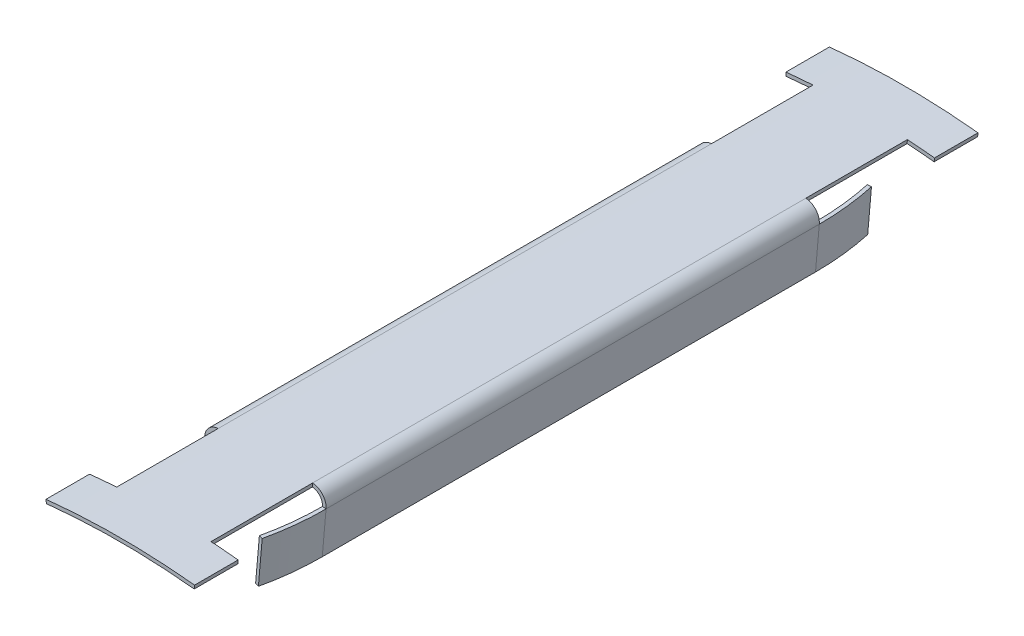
from build123d import *

# Parameters (mm, degrees)
EXTRUSION1_DEPTH = 34
EXTRUSION2_DEPTH = 3
EXTRUSION3_START = 10
EXTRUSION3_DEPTH = 10
EXTRUSION4_DEPTH = 10
EXTRUSION5_START = -3
EXTRUSION5_DEPTH = 3
EXTRUSION6_DEPTH = 3


with BuildPart() as part:
    # Esquisse1 → Extrusion1 (new body)
    with BuildSketch(Plane.XY):
        with BuildLine():
            Line((-3.933519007, 47.82875629), (-3.672032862, 44.839955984))
            Line((-3.672032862, 44.839955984), (-3.921081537, 44.818167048))
            Line((-3.921081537, 44.818167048), (-4.182567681, 47.806967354))
            ThreePointArc((-4.182567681, 47.806967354), (-3.945679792, 48.544855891), (-3.252755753, 48.891917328))
            ThreePointArc((-3.252755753, 48.891917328), (-1.627275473, 48.972971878), (0, 49))
            Line((0, 49), (0, 48.75))
            ThreePointArc((0, 48.75), (-1.618973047, 48.723109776), (-3.236160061, 48.64246877))
            ThreePointArc((-3.236160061, 48.64246877), (-3.75585309, 48.382172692), (-3.933519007, 47.82875629))
        make_face()
    extrusion1 = extrude(amount=EXTRUSION1_DEPTH)

    # Esquisse2 → Extrusion2 (add)
    with BuildSketch(Plane(origin=(-3.921081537, 44.818167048, 0), x_dir=(0.9961946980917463, 0.08715574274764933, 0), z_dir=(0.08715574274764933, -0.9961946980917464, 0))):
        with BuildLine():
            Line((0, 34), (0.25, 34))
            ThreePointArc((0.25, 34), (0.350010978, 35.985052), (0.649031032, 37.95))
            Line((0.649031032, 37.95), (0.404082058, 38))
            ThreePointArc((0.404082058, 38), (0.10127694, 36.01017924), (0, 34))
        make_face()
        with BuildLine():
            Line((0.404082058, -4), (0.649031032, -3.95))
            ThreePointArc((0.649031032, -3.95), (0.350010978, -1.985052), (0.25, 0))
            Line((0.25, 0), (0, 0))
            ThreePointArc((0, 0), (0.10127694, -2.01017924), (0.404082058, -4))
        make_face()
    extrusion2 = extrude(amount=-EXTRUSION2_DEPTH)

    # Esquisse3 → Extrusion3 (add)
    with BuildSketch(Plane(origin=(0, 0, 0), x_dir=(-1, 0, 0), z_dir=(0, 0, -1)).offset(EXTRUSION3_START)):
        with BuildLine():
            Line((3.236160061, 48.64246877), (3.252755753, 48.891917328))
            ThreePointArc((3.252755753, 48.891917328), (1.627275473, 48.972971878), (0, 49))
            Line((0, 49), (0, 48.75))
            ThreePointArc((0, 48.75), (1.618973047, 48.723109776), (3.236160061, 48.64246877))
        make_face()
    extrusion3 = extrude(amount=-EXTRUSION3_DEPTH)

    # Esquisse4 → Extrusion4 (add)
    with BuildSketch(Plane.XY.offset(34)):
        with BuildLine():
            Line((-3.236160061, 48.64246877), (-3.252755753, 48.891917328))
            ThreePointArc((-3.252755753, 48.891917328), (-1.627275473, 48.972971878), (0, 49))
            Line((0, 49), (0, 48.75))
            ThreePointArc((0, 48.75), (-1.618973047, 48.723109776), (-3.236160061, 48.64246877))
        make_face()
    extrusion4 = extrude(amount=EXTRUSION4_DEPTH)

    # Esquisse5 → Extrusion5 (add)
    with BuildSketch(Plane.XY.offset(44).offset(EXTRUSION5_START)):
        with BuildLine():
            Line((-5.1218947, 48.731572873), (-5.095762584, 48.482942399))
            ThreePointArc((-5.095762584, 48.482942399), (-2.551377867, 48.683189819), (0, 48.75))
            Line((0, 48.75), (0, 49))
            ThreePointArc((0, 49), (-2.564461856, 48.932847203), (-5.1218947, 48.731572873))
        make_face()
    extrusion5 = extrude(amount=EXTRUSION5_DEPTH)

    # Esquisse6 → Extrusion6 (add)
    with BuildSketch(Plane(origin=(0, 0, -10), x_dir=(-1, 0, 0), z_dir=(0, 0, -1))):
        with BuildLine():
            Line((0, 49), (0, 48.75))
            ThreePointArc((0, 48.75), (2.551377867, 48.683189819), (5.095762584, 48.482942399))
            Line((5.095762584, 48.482942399), (5.1218947, 48.731572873))
            ThreePointArc((5.1218947, 48.731572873), (2.564461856, 48.932847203), (0, 49))
        make_face()
    extrusion6 = extrude(amount=-EXTRUSION6_DEPTH)

    # Sym_trie1: Extrusion1, Extrusion2, Extrusion3, Extrusion4, Extrusion5, Extrusion6 across plane
    add(extrusion1.mirror(Plane(origin=(0, 48.75, 34), x_dir=(0, 0, 1), z_dir=(-1, 0, 0))))
    add(extrusion2.mirror(Plane(origin=(0, 48.75, 34), x_dir=(0, 0, 1), z_dir=(-1, 0, 0))))
    add(extrusion3.mirror(Plane(origin=(0, 48.75, 34), x_dir=(0, 0, 1), z_dir=(-1, 0, 0))))
    add(extrusion4.mirror(Plane(origin=(0, 48.75, 34), x_dir=(0, 0, 1), z_dir=(-1, 0, 0))))
    add(extrusion5.mirror(Plane(origin=(0, 48.75, 34), x_dir=(0, 0, 1), z_dir=(-1, 0, 0))))
    add(extrusion6.mirror(Plane(origin=(0, 48.75, 34), x_dir=(0, 0, 1), z_dir=(-1, 0, 0))))


solid = part.part
